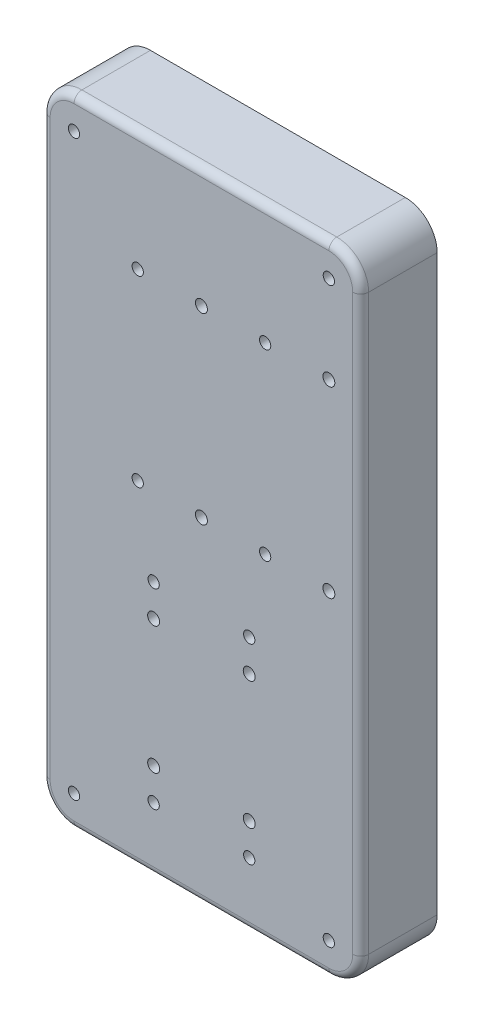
from build123d import *

# Parameters (mm, degrees)
SKETCH1_W                                      = 127
SKETCH1_H                                      = 254
EXTRUDE1_DEPTH                                 = 30.48
CSK_FOR_8_FLAT_HEAD_MACHINE_SCREW1_D           = 4.4958
CSK_FOR_8_FLAT_HEAD_MACHINE_SCREW1_CSINK_D     = 9.7575878
CSK_FOR_8_FLAT_HEAD_MACHINE_SCREW1_CSINK_ANGLE = 82
SKETCH4_R                                      = 2.38125
CUT_EXTRUDE1_DEPTH                             = 146.224930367
FILLET1_R                                      = 12.7
FILLET2_R                                      = 3.175
F_8_CLEARANCE_HOLE1_D                          = 4.4958


with BuildPart() as part:
    # Sketch1 → Extrude1 (new body)
    with BuildSketch(Plane.XY):
        Rectangle(SKETCH1_W, SKETCH1_H)
    extrude(amount=EXTRUDE1_DEPTH)

    # CSK for _8 Flat Head Machine Screw1 (through all)
    with Locations(Plane(origin=(0, 0, 0), x_dir=(-1, 0, 0), z_dir=(0, 0, -1))):
        with Locations((25.4, 79.375), (-25.4, 79.375), (25.4, 6.35), (-25.4, 6.35), (-19.05, -25.4), (-19.05, -101.6), (19.05, -101.6), (19.05, -25.4)):
            CounterSinkHole(CSK_FOR_8_FLAT_HEAD_MACHINE_SCREW1_D / 2, CSK_FOR_8_FLAT_HEAD_MACHINE_SCREW1_CSINK_D / 2, counter_sink_angle=CSK_FOR_8_FLAT_HEAD_MACHINE_SCREW1_CSINK_ANGLE)

    # Sketch4 → Cut-Extrude1 (cut, through all)
    with BuildSketch(Plane(origin=(0, 0, 0), x_dir=(-1, 0, 0), z_dir=(0, 0, -1))):
        with Locations((19.05, -88.9)):
            Circle(SKETCH4_R)
        with Locations((19.05, -38.1)):
            Circle(SKETCH4_R)
        with Locations((-19.05, -38.1)):
            Circle(SKETCH4_R)
        with Locations((-19.05, -88.9)):
            Circle(SKETCH4_R)
        with Locations((0, 6.35)):
            Circle(SKETCH4_R)
        with Locations((-50.8, 6.35)):
            Circle(SKETCH4_R)
        with Locations((-50.8, 79.375)):
            Circle(SKETCH4_R)
        with Locations((0, 79.375)):
            Circle(SKETCH4_R)
    extrude(amount=-CUT_EXTRUDE1_DEPTH, mode=Mode.SUBTRACT)

    # Fillet1
    fillet1_edges = [part.edges().sort_by_distance(p)[0] for p in [
        (-63.5, 127, 15.24),
        (63.5, 127, 15.24),
        (63.5, -127, 15.24),
        (-63.5, -127, 15.24),
    ]]
    fillet(fillet1_edges, radius=FILLET1_R)

    # Fillet2
    fillet2_edges = [part.edges().sort_by_distance(p)[0] for p in [
        (-63.5, 0, 30.48),
        (0, 127, 30.48),
        (0, -127, 30.48),
        (63.5, 0, 30.48),
        (-59.780256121, -123.280256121, 30.48),
        (59.780256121, -123.280256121, 30.48),
        (59.780256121, 123.280256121, 30.48),
        (-59.780256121, 123.280256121, 30.48),
    ]]
    fillet(fillet2_edges, radius=FILLET2_R)

    # 8 Clearance Hole1 (through all)
    with Locations(Plane.XY.offset(30.48)):
        with Locations((-50.8, 114.3), (50.8, 114.3), (50.8, -114.3), (-50.8, -114.3)):
            Hole(F_8_CLEARANCE_HOLE1_D / 2)


solid = part.part
